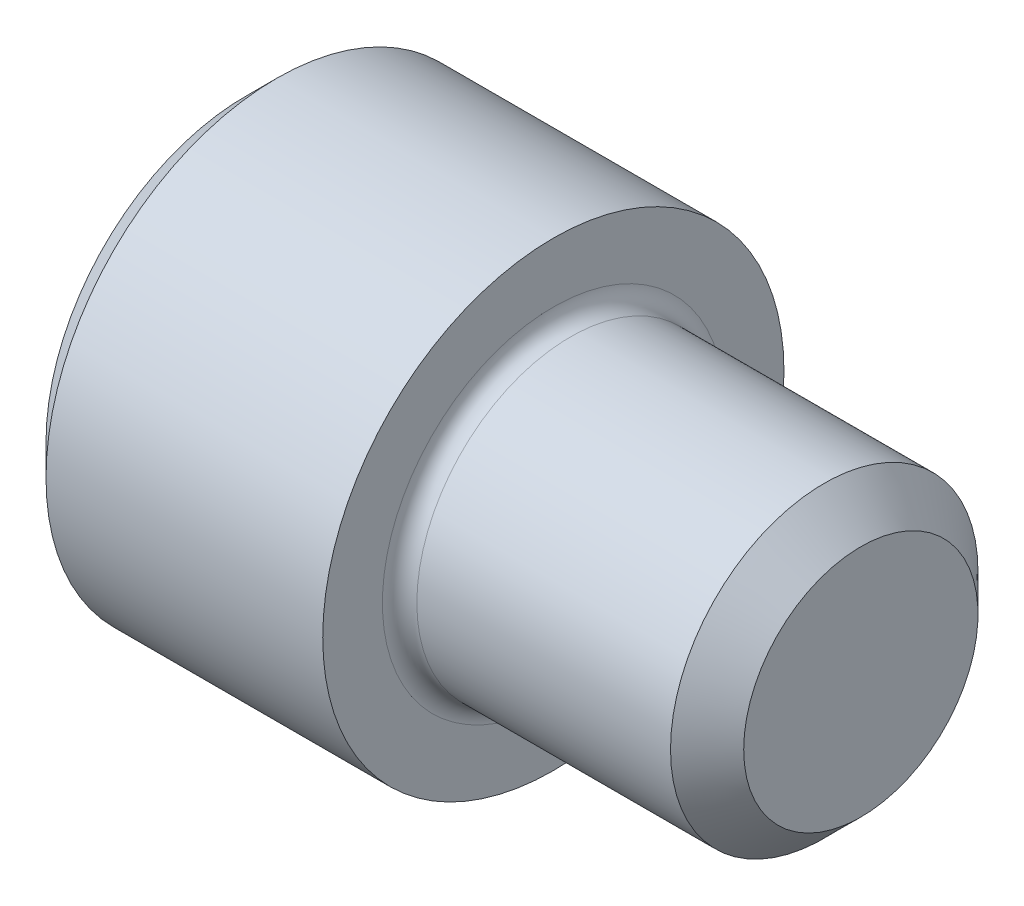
ISO-10303-21;
HEADER;
FILE_DESCRIPTION(('STEP AP214'),'2;1');
FILE_NAME('part.step','',(''),(''),'','','');
FILE_SCHEMA(('AUTOMOTIVE_DESIGN { 1 0 10303 214 1 1 1 1 }'));
ENDSEC;
DATA;
#1=APPLICATION_CONTEXT('core data for automotive mechanical design processes');
#2=APPLICATION_PROTOCOL_DEFINITION('international standard','automotive_design',2000,#1);
#3=PRODUCT_CONTEXT('',#1,'mechanical');
#4=PRODUCT('Part','Part','',(#3));
#5=PRODUCT_RELATED_PRODUCT_CATEGORY('part','',(#4));
#6=PRODUCT_DEFINITION_FORMATION('','',#4);
#7=PRODUCT_DEFINITION_CONTEXT('part definition',#1,'design');
#8=PRODUCT_DEFINITION('design','',#6,#7);
#9=PRODUCT_DEFINITION_SHAPE('','',#8);
#10=(LENGTH_UNIT() NAMED_UNIT(*) SI_UNIT(.MILLI.,.METRE.));
#11=(NAMED_UNIT(*) PLANE_ANGLE_UNIT() SI_UNIT($,.RADIAN.));
#12=(NAMED_UNIT(*) SI_UNIT($,.STERADIAN.) SOLID_ANGLE_UNIT());
#13=UNCERTAINTY_MEASURE_WITH_UNIT(LENGTH_MEASURE(1.E-05),#10,'distance_accuracy_value','');
#14=(GEOMETRIC_REPRESENTATION_CONTEXT(3) GLOBAL_UNCERTAINTY_ASSIGNED_CONTEXT((#13)) GLOBAL_UNIT_ASSIGNED_CONTEXT((#10,
#11,#12)) REPRESENTATION_CONTEXT('',''));
#15=CARTESIAN_POINT('',(0.,0.,0.));
#16=DIRECTION('',(0.,0.,1.));
#17=DIRECTION('',(1.,0.,0.));
#18=AXIS2_PLACEMENT_3D('',#15,#16,#17);
#19=CARTESIAN_POINT('',(0.,0.,0.));
#20=DIRECTION('',(-1.,0.,0.));
#21=DIRECTION('',(0.,0.,1.));
#22=AXIS2_PLACEMENT_3D('',#19,#20,#21);
#23=PLANE('',#22);
#24=DIRECTION('',(0.,-0.499999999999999,0.866025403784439));
#25=VECTOR('',#24,1.);
#26=CARTESIAN_POINT('',(0.,2.7496306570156,0.));
#27=LINE('',#26,#25);
#28=CARTESIAN_POINT('',(0.,2.7496306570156,0.));
#29=VERTEX_POINT('',#28);
#30=CARTESIAN_POINT('',(0.,1.3748153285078,2.38125));
#31=VERTEX_POINT('',#30);
#32=EDGE_CURVE('E262',#29,#31,#27,.T.);
#33=ORIENTED_EDGE('',*,*,#32,.T.);
#34=DIRECTION('',(0.,1.,0.));
#35=VECTOR('',#34,1.);
#36=CARTESIAN_POINT('',(0.,-1.37481532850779,2.38125));
#37=LINE('',#36,#35);
#38=CARTESIAN_POINT('',(0.,-1.37481532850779,2.38125));
#39=VERTEX_POINT('',#38);
#40=EDGE_CURVE('E122',#39,#31,#37,.T.);
#41=ORIENTED_EDGE('',*,*,#40,.F.);
#42=DIRECTION('',(0.,-0.500000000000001,-0.866025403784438));
#43=VECTOR('',#42,1.);
#44=CARTESIAN_POINT('',(0.,-1.37481532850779,2.38125));
#45=LINE('',#44,#43);
#46=CARTESIAN_POINT('',(0.,-2.74963065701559,0.));
#47=VERTEX_POINT('',#46);
#48=EDGE_CURVE('E265',#39,#47,#45,.T.);
#49=ORIENTED_EDGE('',*,*,#48,.T.);
#50=DIRECTION('',(0.,0.499999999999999,-0.866025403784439));
#51=VECTOR('',#50,1.);
#52=CARTESIAN_POINT('',(0.,-2.74963065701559,0.));
#53=LINE('',#52,#51);
#54=CARTESIAN_POINT('',(0.,-1.3748153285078,-2.38125));
#55=VERTEX_POINT('',#54);
#56=EDGE_CURVE('E268',#47,#55,#53,.T.);
#57=ORIENTED_EDGE('',*,*,#56,.T.);
#58=DIRECTION('',(0.,-1.,0.));
#59=VECTOR('',#58,1.);
#60=CARTESIAN_POINT('',(0.,1.3748153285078,-2.38125));
#61=LINE('',#60,#59);
#62=CARTESIAN_POINT('',(0.,1.3748153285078,-2.38125));
#63=VERTEX_POINT('',#62);
#64=EDGE_CURVE('E271',#63,#55,#61,.T.);
#65=ORIENTED_EDGE('',*,*,#64,.F.);
#66=DIRECTION('',(0.,-0.500000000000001,-0.866025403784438));
#67=VECTOR('',#66,1.);
#68=CARTESIAN_POINT('',(0.,2.7496306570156,0.));
#69=LINE('',#68,#67);
#70=EDGE_CURVE('E117',#29,#63,#69,.T.);
#71=ORIENTED_EDGE('',*,*,#70,.F.);
#72=EDGE_LOOP('',(#33,#41,#49,#57,#65,#71));
#73=FACE_BOUND('',#72,.T.);
#74=CARTESIAN_POINT('',(0.,0.,0.));
#75=DIRECTION('',(-1.,0.,0.));
#76=DIRECTION('',(0.,0.,1.));
#77=AXIS2_PLACEMENT_3D('',#74,#75,#76);
#78=CIRCLE('',#77,4.12749999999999);
#79=CARTESIAN_POINT('',(0.,0.,4.12749999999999));
#80=VERTEX_POINT('',#79);
#81=EDGE_CURVE('E146',#80,#80,#78,.T.);
#82=ORIENTED_EDGE('',*,*,#81,.T.);
#83=EDGE_LOOP('',(#82));
#84=FACE_BOUND('',#83,.T.);
#85=ADVANCED_FACE('F30',(#73,#84),#23,.T.);
#86=CARTESIAN_POINT('',(0.,0.,0.));
#87=DIRECTION('',(1.,0.,0.));
#88=DIRECTION('',(0.,0.,-1.));
#89=AXIS2_PLACEMENT_3D('',#86,#87,#88);
#90=CONICAL_SURFACE('',#89,4.12749999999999,0.785398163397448);
#91=CARTESIAN_POINT('',(0.635000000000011,0.,0.));
#92=DIRECTION('',(-1.,0.,0.));
#93=DIRECTION('',(0.,0.,1.));
#94=AXIS2_PLACEMENT_3D('',#91,#92,#93);
#95=CIRCLE('',#94,4.7625);
#96=CARTESIAN_POINT('',(0.635000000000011,0.,4.7625));
#97=VERTEX_POINT('',#96);
#98=EDGE_CURVE('E143',#97,#97,#95,.T.);
#99=ORIENTED_EDGE('',*,*,#98,.T.);
#100=EDGE_LOOP('',(#99));
#101=FACE_BOUND('',#100,.T.);
#102=ORIENTED_EDGE('',*,*,#81,.F.);
#103=EDGE_LOOP('',(#102));
#104=FACE_BOUND('',#103,.T.);
#105=ADVANCED_FACE('F167',(#101,#104),#90,.T.);
#106=CARTESIAN_POINT('',(-31.75,0.,0.));
#107=DIRECTION('',(-1.,0.,0.));
#108=DIRECTION('',(0.,0.,1.));
#109=AXIS2_PLACEMENT_3D('',#106,#107,#108);
#110=CYLINDRICAL_SURFACE('',#109,4.7625);
#111=CARTESIAN_POINT('',(6.35000000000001,0.,0.));
#112=DIRECTION('',(-1.,0.,0.));
#113=DIRECTION('',(0.,0.,1.));
#114=AXIS2_PLACEMENT_3D('',#111,#112,#113);
#115=CIRCLE('',#114,4.7625);
#116=CARTESIAN_POINT('',(6.35000000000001,0.,4.7625));
#117=VERTEX_POINT('',#116);
#118=EDGE_CURVE('E140',#117,#117,#115,.T.);
#119=ORIENTED_EDGE('',*,*,#118,.T.);
#120=EDGE_LOOP('',(#119));
#121=FACE_BOUND('',#120,.T.);
#122=ORIENTED_EDGE('',*,*,#98,.F.);
#123=EDGE_LOOP('',(#122));
#124=FACE_BOUND('',#123,.T.);
#125=ADVANCED_FACE('F172',(#121,#124),#110,.T.);
#126=CARTESIAN_POINT('',(6.35,4.7625,0.));
#127=DIRECTION('',(1.,0.,0.));
#128=DIRECTION('',(0.,0.,-1.));
#129=AXIS2_PLACEMENT_3D('',#126,#127,#128);
#130=PLANE('',#129);
#131=CARTESIAN_POINT('',(6.35,0.,0.));
#132=DIRECTION('',(1.,0.,0.));
#133=DIRECTION('',(0.,0.,-1.));
#134=AXIS2_PLACEMENT_3D('',#131,#132,#133);
#135=CIRCLE('',#134,3.5306);
#136=CARTESIAN_POINT('',(6.35,0.,-3.5306));
#137=VERTEX_POINT('',#136);
#138=EDGE_CURVE('E38',#137,#137,#135,.F.);
#139=ORIENTED_EDGE('',*,*,#138,.T.);
#140=EDGE_LOOP('',(#139));
#141=FACE_BOUND('',#140,.T.);
#142=ORIENTED_EDGE('',*,*,#118,.F.);
#143=EDGE_LOOP('',(#142));
#144=FACE_BOUND('',#143,.T.);
#145=ADVANCED_FACE('F151',(#141,#144),#130,.T.);
#146=CARTESIAN_POINT('',(-31.75,0.,0.));
#147=DIRECTION('',(-1.,0.,0.));
#148=DIRECTION('',(0.,0.,1.));
#149=AXIS2_PLACEMENT_3D('',#146,#147,#148);
#150=CYLINDRICAL_SURFACE('',#149,3.175);
#151=CARTESIAN_POINT('',(6.7056,0.,0.));
#152=DIRECTION('',(1.,0.,0.));
#153=DIRECTION('',(0.,0.,-1.));
#154=AXIS2_PLACEMENT_3D('',#151,#152,#153);
#155=CIRCLE('',#154,3.175);
#156=CARTESIAN_POINT('',(6.7056,0.,-3.175));
#157=VERTEX_POINT('',#156);
#158=EDGE_CURVE('E11',#157,#157,#155,.T.);
#159=ORIENTED_EDGE('',*,*,#158,.T.);
#160=EDGE_LOOP('',(#159));
#161=FACE_BOUND('',#160,.T.);
#162=CARTESIAN_POINT('',(11.94435,0.,0.));
#163=DIRECTION('',(-1.,0.,0.));
#164=DIRECTION('',(0.,0.,1.));
#165=AXIS2_PLACEMENT_3D('',#162,#163,#164);
#166=CIRCLE('',#165,3.175);
#167=CARTESIAN_POINT('',(11.94435,0.,3.175));
#168=VERTEX_POINT('',#167);
#169=EDGE_CURVE('E137',#168,#168,#166,.T.);
#170=ORIENTED_EDGE('',*,*,#169,.T.);
#171=EDGE_LOOP('',(#170));
#172=FACE_BOUND('',#171,.T.);
#173=ADVANCED_FACE('F182',(#161,#172),#150,.T.);
#174=CARTESIAN_POINT('',(12.7,0.,0.));
#175=DIRECTION('',(-1.,0.,0.));
#176=DIRECTION('',(0.,0.,1.));
#177=AXIS2_PLACEMENT_3D('',#174,#175,#176);
#178=CONICAL_SURFACE('',#177,2.41935,0.78539816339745);
#179=ORIENTED_EDGE('',*,*,#169,.F.);
#180=EDGE_LOOP('',(#179));
#181=FACE_BOUND('',#180,.T.);
#182=CARTESIAN_POINT('',(12.7,0.,0.));
#183=DIRECTION('',(-1.,0.,0.));
#184=DIRECTION('',(0.,0.,1.));
#185=AXIS2_PLACEMENT_3D('',#182,#183,#184);
#186=CIRCLE('',#185,2.41935);
#187=CARTESIAN_POINT('',(12.7,0.,2.41935));
#188=VERTEX_POINT('',#187);
#189=EDGE_CURVE('E133',#188,#188,#186,.T.);
#190=ORIENTED_EDGE('',*,*,#189,.T.);
#191=EDGE_LOOP('',(#190));
#192=FACE_BOUND('',#191,.T.);
#193=ADVANCED_FACE('F162',(#181,#192),#178,.T.);
#194=CARTESIAN_POINT('',(12.7,2.41935,0.));
#195=DIRECTION('',(1.,0.,0.));
#196=DIRECTION('',(0.,0.,-1.));
#197=AXIS2_PLACEMENT_3D('',#194,#195,#196);
#198=PLANE('',#197);
#199=ORIENTED_EDGE('',*,*,#189,.F.);
#200=EDGE_LOOP('',(#199));
#201=FACE_BOUND('',#200,.T.);
#202=ADVANCED_FACE('F155',(#201),#198,.T.);
#203=CARTESIAN_POINT('',(6.7056,0.,0.));
#204=DIRECTION('',(1.,0.,0.));
#205=DIRECTION('',(0.,0.,-1.));
#206=AXIS2_PLACEMENT_3D('',#203,#204,#205);
#207=TOROIDAL_SURFACE('',#206,3.5306,0.3556);
#208=ORIENTED_EDGE('',*,*,#158,.F.);
#209=EDGE_LOOP('',(#208));
#210=FACE_BOUND('',#209,.T.);
#211=ORIENTED_EDGE('',*,*,#138,.F.);
#212=EDGE_LOOP('',(#211));
#213=FACE_BOUND('',#212,.T.);
#214=ADVANCED_FACE('F32',(#210,#213),#207,.F.);
#215=CARTESIAN_POINT('',(3.048,2.7496306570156,0.));
#216=DIRECTION('',(0.,-0.866025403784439,-0.499999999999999));
#217=DIRECTION('',(0.,0.499999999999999,-0.866025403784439));
#218=AXIS2_PLACEMENT_3D('',#215,#216,#217);
#219=PLANE('',#218);
#220=ORIENTED_EDGE('',*,*,#32,.F.);
#221=DIRECTION('',(-1.,0.,0.));
#222=VECTOR('',#221,1.);
#223=CARTESIAN_POINT('',(3.048,2.7496306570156,0.));
#224=LINE('',#223,#222);
#225=CARTESIAN_POINT('',(3.048,2.7496306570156,0.));
#226=VERTEX_POINT('',#225);
#227=EDGE_CURVE('E261',#226,#29,#224,.T.);
#228=ORIENTED_EDGE('',*,*,#227,.F.);
#229=DIRECTION('',(0.,-0.499999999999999,0.866025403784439));
#230=VECTOR('',#229,1.);
#231=CARTESIAN_POINT('',(3.048,2.7496306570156,0.));
#232=LINE('',#231,#230);
#233=CARTESIAN_POINT('',(3.04800000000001,2.0622229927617,1.190625));
#234=VERTEX_POINT('',#233);
#235=EDGE_CURVE('E45',#226,#234,#232,.T.);
#236=ORIENTED_EDGE('',*,*,#235,.T.);
#237=CARTESIAN_POINT('',(3.048,1.3748153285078,2.38125));
#238=VERTEX_POINT('',#237);
#239=EDGE_CURVE('E103',#234,#238,#232,.T.);
#240=ORIENTED_EDGE('',*,*,#239,.T.);
#241=DIRECTION('',(-1.,0.,0.));
#242=VECTOR('',#241,1.);
#243=CARTESIAN_POINT('',(3.048,1.3748153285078,2.38125));
#244=LINE('',#243,#242);
#245=EDGE_CURVE('E115',#238,#31,#244,.T.);
#246=ORIENTED_EDGE('',*,*,#245,.T.);
#247=EDGE_LOOP('',(#220,#228,#236,#240,#246));
#248=FACE_BOUND('',#247,.T.);
#249=ADVANCED_FACE('F114',(#248),#219,.T.);
#250=CARTESIAN_POINT('',(3.048,-1.37481532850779,2.38125));
#251=DIRECTION('',(0.,0.,1.));
#252=DIRECTION('',(0.,-1.,0.));
#253=AXIS2_PLACEMENT_3D('',#250,#251,#252);
#254=PLANE('',#253);
#255=ORIENTED_EDGE('',*,*,#40,.T.);
#256=ORIENTED_EDGE('',*,*,#245,.F.);
#257=DIRECTION('',(0.,1.,0.));
#258=VECTOR('',#257,1.);
#259=CARTESIAN_POINT('',(3.048,-1.37481532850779,2.38125));
#260=LINE('',#259,#258);
#261=CARTESIAN_POINT('',(3.048,0.,2.38125));
#262=VERTEX_POINT('',#261);
#263=EDGE_CURVE('E101',#262,#238,#260,.T.);
#264=ORIENTED_EDGE('',*,*,#263,.F.);
#265=CARTESIAN_POINT('',(3.048,-1.37481532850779,2.38125));
#266=VERTEX_POINT('',#265);
#267=EDGE_CURVE('E111',#266,#262,#260,.T.);
#268=ORIENTED_EDGE('',*,*,#267,.F.);
#269=DIRECTION('',(-1.,0.,0.));
#270=VECTOR('',#269,1.);
#271=CARTESIAN_POINT('',(3.048,-1.37481532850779,2.38125));
#272=LINE('',#271,#270);
#273=EDGE_CURVE('E124',#266,#39,#272,.T.);
#274=ORIENTED_EDGE('',*,*,#273,.T.);
#275=EDGE_LOOP('',(#255,#256,#264,#268,#274));
#276=FACE_BOUND('',#275,.T.);
#277=ADVANCED_FACE('F119',(#276),#254,.F.);
#278=CARTESIAN_POINT('',(3.048,-1.37481532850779,2.38125));
#279=DIRECTION('',(0.,0.866025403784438,-0.500000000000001));
#280=DIRECTION('',(0.,0.500000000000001,0.866025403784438));
#281=AXIS2_PLACEMENT_3D('',#278,#279,#280);
#282=PLANE('',#281);
#283=ORIENTED_EDGE('',*,*,#48,.F.);
#284=ORIENTED_EDGE('',*,*,#273,.F.);
#285=DIRECTION('',(0.,-0.500000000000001,-0.866025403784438));
#286=VECTOR('',#285,1.);
#287=CARTESIAN_POINT('',(3.048,-1.37481532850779,2.38125));
#288=LINE('',#287,#286);
#289=CARTESIAN_POINT('',(3.048,-2.06222299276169,1.190625));
#290=VERTEX_POINT('',#289);
#291=EDGE_CURVE('E242',#266,#290,#288,.T.);
#292=ORIENTED_EDGE('',*,*,#291,.T.);
#293=CARTESIAN_POINT('',(3.048,-2.74963065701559,0.));
#294=VERTEX_POINT('',#293);
#295=EDGE_CURVE('E244',#290,#294,#288,.T.);
#296=ORIENTED_EDGE('',*,*,#295,.T.);
#297=DIRECTION('',(-1.,0.,0.));
#298=VECTOR('',#297,1.);
#299=CARTESIAN_POINT('',(3.048,-2.74963065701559,0.));
#300=LINE('',#299,#298);
#301=EDGE_CURVE('E129',#294,#47,#300,.T.);
#302=ORIENTED_EDGE('',*,*,#301,.T.);
#303=EDGE_LOOP('',(#283,#284,#292,#296,#302));
#304=FACE_BOUND('',#303,.T.);
#305=ADVANCED_FACE('F194',(#304),#282,.T.);
#306=CARTESIAN_POINT('',(3.048,-2.74963065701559,0.));
#307=DIRECTION('',(0.,0.866025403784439,0.499999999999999));
#308=DIRECTION('',(0.,-0.499999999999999,0.86602540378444));
#309=AXIS2_PLACEMENT_3D('',#306,#307,#308);
#310=PLANE('',#309);
#311=ORIENTED_EDGE('',*,*,#56,.F.);
#312=ORIENTED_EDGE('',*,*,#301,.F.);
#313=DIRECTION('',(0.,0.499999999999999,-0.866025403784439));
#314=VECTOR('',#313,1.);
#315=CARTESIAN_POINT('',(3.048,-2.74963065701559,0.));
#316=LINE('',#315,#314);
#317=CARTESIAN_POINT('',(3.048,-2.06222299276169,-1.190625));
#318=VERTEX_POINT('',#317);
#319=EDGE_CURVE('E247',#294,#318,#316,.T.);
#320=ORIENTED_EDGE('',*,*,#319,.T.);
#321=CARTESIAN_POINT('',(3.048,-1.3748153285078,-2.38125));
#322=VERTEX_POINT('',#321);
#323=EDGE_CURVE('E251',#318,#322,#316,.T.);
#324=ORIENTED_EDGE('',*,*,#323,.T.);
#325=DIRECTION('',(-1.,0.,0.));
#326=VECTOR('',#325,1.);
#327=CARTESIAN_POINT('',(3.048,-1.3748153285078,-2.38125));
#328=LINE('',#327,#326);
#329=EDGE_CURVE('E280',#322,#55,#328,.T.);
#330=ORIENTED_EDGE('',*,*,#329,.T.);
#331=EDGE_LOOP('',(#311,#312,#320,#324,#330));
#332=FACE_BOUND('',#331,.T.);
#333=ADVANCED_FACE('F197',(#332),#310,.T.);
#334=CARTESIAN_POINT('',(3.048,1.3748153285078,-2.38125));
#335=DIRECTION('',(0.,0.,-1.));
#336=DIRECTION('',(0.,1.,0.));
#337=AXIS2_PLACEMENT_3D('',#334,#335,#336);
#338=PLANE('',#337);
#339=ORIENTED_EDGE('',*,*,#64,.T.);
#340=ORIENTED_EDGE('',*,*,#329,.F.);
#341=DIRECTION('',(0.,-1.,0.));
#342=VECTOR('',#341,1.);
#343=CARTESIAN_POINT('',(3.048,1.3748153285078,-2.38125));
#344=LINE('',#343,#342);
#345=CARTESIAN_POINT('',(3.048,0.,-2.38125));
#346=VERTEX_POINT('',#345);
#347=EDGE_CURVE('E255',#346,#322,#344,.T.);
#348=ORIENTED_EDGE('',*,*,#347,.F.);
#349=CARTESIAN_POINT('',(3.048,1.3748153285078,-2.38125));
#350=VERTEX_POINT('',#349);
#351=EDGE_CURVE('E256',#350,#346,#344,.T.);
#352=ORIENTED_EDGE('',*,*,#351,.F.);
#353=DIRECTION('',(-1.,0.,0.));
#354=VECTOR('',#353,1.);
#355=CARTESIAN_POINT('',(3.048,1.3748153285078,-2.38125));
#356=LINE('',#355,#354);
#357=EDGE_CURVE('E277',#350,#63,#356,.T.);
#358=ORIENTED_EDGE('',*,*,#357,.T.);
#359=EDGE_LOOP('',(#339,#340,#348,#352,#358));
#360=FACE_BOUND('',#359,.T.);
#361=ADVANCED_FACE('F201',(#360),#338,.F.);
#362=CARTESIAN_POINT('',(3.048,2.7496306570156,0.));
#363=DIRECTION('',(0.,0.866025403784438,-0.500000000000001));
#364=DIRECTION('',(0.,0.500000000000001,0.866025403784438));
#365=AXIS2_PLACEMENT_3D('',#362,#363,#364);
#366=PLANE('',#365);
#367=ORIENTED_EDGE('',*,*,#70,.T.);
#368=ORIENTED_EDGE('',*,*,#357,.F.);
#369=DIRECTION('',(0.,-0.500000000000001,-0.866025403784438));
#370=VECTOR('',#369,1.);
#371=CARTESIAN_POINT('',(3.048,2.7496306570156,0.));
#372=LINE('',#371,#370);
#373=CARTESIAN_POINT('',(3.048,2.0622229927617,-1.190625));
#374=VERTEX_POINT('',#373);
#375=EDGE_CURVE('E259',#374,#350,#372,.T.);
#376=ORIENTED_EDGE('',*,*,#375,.F.);
#377=EDGE_CURVE('E233',#226,#374,#372,.T.);
#378=ORIENTED_EDGE('',*,*,#377,.F.);
#379=ORIENTED_EDGE('',*,*,#227,.T.);
#380=EDGE_LOOP('',(#367,#368,#376,#378,#379));
#381=FACE_BOUND('',#380,.T.);
#382=ADVANCED_FACE('F205',(#381),#366,.F.);
#383=CARTESIAN_POINT('',(3.048,1.3748153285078,2.38125));
#384=DIRECTION('',(-1.,0.,0.));
#385=DIRECTION('',(0.,0.,1.));
#386=AXIS2_PLACEMENT_3D('',#383,#384,#385);
#387=PLANE('',#386);
#388=CARTESIAN_POINT('',(3.04800000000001,0.,0.));
#389=DIRECTION('',(-1.,0.,0.));
#390=DIRECTION('',(0.,0.,1.));
#391=AXIS2_PLACEMENT_3D('',#388,#389,#390);
#392=CIRCLE('',#391,2.38125);
#393=EDGE_CURVE('E123',#290,#262,#392,.T.);
#394=ORIENTED_EDGE('',*,*,#393,.F.);
#395=ORIENTED_EDGE('',*,*,#291,.F.);
#396=ORIENTED_EDGE('',*,*,#267,.T.);
#397=EDGE_LOOP('',(#394,#395,#396));
#398=FACE_BOUND('',#397,.T.);
#399=ADVANCED_FACE('F209',(#398),#387,.T.);
#400=EDGE_CURVE('E127',#318,#290,#392,.T.);
#401=ORIENTED_EDGE('',*,*,#400,.F.);
#402=ORIENTED_EDGE('',*,*,#319,.F.);
#403=ORIENTED_EDGE('',*,*,#295,.F.);
#404=EDGE_LOOP('',(#401,#402,#403));
#405=FACE_BOUND('',#404,.T.);
#406=ADVANCED_FACE('F212',(#405),#387,.T.);
#407=EDGE_CURVE('E286',#346,#318,#392,.T.);
#408=ORIENTED_EDGE('',*,*,#407,.F.);
#409=ORIENTED_EDGE('',*,*,#347,.T.);
#410=ORIENTED_EDGE('',*,*,#323,.F.);
#411=EDGE_LOOP('',(#408,#409,#410));
#412=FACE_BOUND('',#411,.T.);
#413=ADVANCED_FACE('F217',(#412),#387,.T.);
#414=EDGE_CURVE('E236',#374,#346,#392,.T.);
#415=ORIENTED_EDGE('',*,*,#414,.F.);
#416=ORIENTED_EDGE('',*,*,#375,.T.);
#417=ORIENTED_EDGE('',*,*,#351,.T.);
#418=EDGE_LOOP('',(#415,#416,#417));
#419=FACE_BOUND('',#418,.T.);
#420=ADVANCED_FACE('F224',(#419),#387,.T.);
#421=EDGE_CURVE('E134',#234,#374,#392,.T.);
#422=ORIENTED_EDGE('',*,*,#421,.F.);
#423=ORIENTED_EDGE('',*,*,#235,.F.);
#424=ORIENTED_EDGE('',*,*,#377,.T.);
#425=EDGE_LOOP('',(#422,#423,#424));
#426=FACE_BOUND('',#425,.T.);
#427=ADVANCED_FACE('F220',(#426),#387,.T.);
#428=EDGE_CURVE('E106',#262,#234,#392,.T.);
#429=ORIENTED_EDGE('',*,*,#428,.F.);
#430=ORIENTED_EDGE('',*,*,#263,.T.);
#431=ORIENTED_EDGE('',*,*,#239,.F.);
#432=EDGE_LOOP('',(#429,#430,#431));
#433=FACE_BOUND('',#432,.T.);
#434=ADVANCED_FACE('F102',(#433),#387,.T.);
#435=CARTESIAN_POINT('',(3.04800000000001,0.,0.));
#436=DIRECTION('',(-1.,0.,0.));
#437=DIRECTION('',(0.,0.,1.));
#438=AXIS2_PLACEMENT_3D('',#435,#436,#437);
#439=CONICAL_SURFACE('',#438,2.38125,1.04719755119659);
#440=CARTESIAN_POINT('',(4.42281532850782,0.,0.));
#441=VERTEX_POINT('',#440);
#442=VERTEX_LOOP('',#441);
#443=FACE_BOUND('',#442,.T.);
#444=ORIENTED_EDGE('',*,*,#428,.T.);
#445=ORIENTED_EDGE('',*,*,#421,.T.);
#446=ORIENTED_EDGE('',*,*,#414,.T.);
#447=ORIENTED_EDGE('',*,*,#407,.T.);
#448=ORIENTED_EDGE('',*,*,#400,.T.);
#449=ORIENTED_EDGE('',*,*,#393,.T.);
#450=EDGE_LOOP('',(#444,#445,#446,#447,#448,#449));
#451=FACE_BOUND('',#450,.T.);
#452=ADVANCED_FACE('F189',(#443,#451),#439,.F.);
#453=CLOSED_SHELL('',(#85,#105,#125,#145,#173,#193,#202,#214,#249,#277,#305,#333,#361,#382,#399,
#406,#413,#420,#427,#434,#452));
#454=MANIFOLD_SOLID_BREP('B2',#453);
#455=ADVANCED_BREP_SHAPE_REPRESENTATION('',(#18,#454),#14);
#456=SHAPE_DEFINITION_REPRESENTATION(#9,#455);
ENDSEC;
END-ISO-10303-21;
